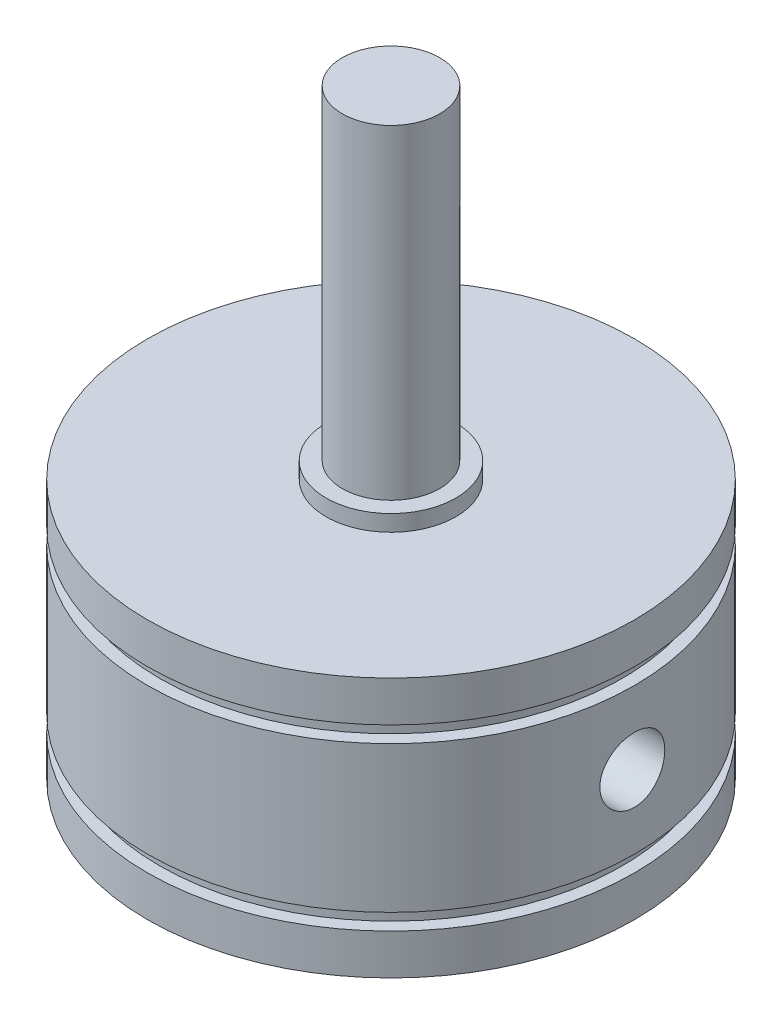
ISO-10303-21;
HEADER;
FILE_DESCRIPTION(('STEP AP214'),'2;1');
FILE_NAME('part.step','',(''),(''),'','','');
FILE_SCHEMA(('AUTOMOTIVE_DESIGN { 1 0 10303 214 1 1 1 1 }'));
ENDSEC;
DATA;
#1=APPLICATION_CONTEXT('core data for automotive mechanical design processes');
#2=APPLICATION_PROTOCOL_DEFINITION('international standard','automotive_design',2000,#1);
#3=PRODUCT_CONTEXT('',#1,'mechanical');
#4=PRODUCT('Part','Part','',(#3));
#5=PRODUCT_RELATED_PRODUCT_CATEGORY('part','',(#4));
#6=PRODUCT_DEFINITION_FORMATION('','',#4);
#7=PRODUCT_DEFINITION_CONTEXT('part definition',#1,'design');
#8=PRODUCT_DEFINITION('design','',#6,#7);
#9=PRODUCT_DEFINITION_SHAPE('','',#8);
#10=(LENGTH_UNIT() NAMED_UNIT(*) SI_UNIT(.MILLI.,.METRE.));
#11=(NAMED_UNIT(*) PLANE_ANGLE_UNIT() SI_UNIT($,.RADIAN.));
#12=(NAMED_UNIT(*) SI_UNIT($,.STERADIAN.) SOLID_ANGLE_UNIT());
#13=UNCERTAINTY_MEASURE_WITH_UNIT(LENGTH_MEASURE(1.E-05),#10,'distance_accuracy_value','');
#14=(GEOMETRIC_REPRESENTATION_CONTEXT(3) GLOBAL_UNCERTAINTY_ASSIGNED_CONTEXT((#13)) GLOBAL_UNIT_ASSIGNED_CONTEXT((#10,
#11,#12)) REPRESENTATION_CONTEXT('',''));
#15=CARTESIAN_POINT('',(0.,0.,0.));
#16=DIRECTION('',(0.,0.,1.));
#17=DIRECTION('',(1.,0.,0.));
#18=AXIS2_PLACEMENT_3D('',#15,#16,#17);
#19=CARTESIAN_POINT('',(3.00000000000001,-12.,0.));
#20=DIRECTION('',(0.,-1.,0.));
#21=DIRECTION('',(0.,0.,-1.));
#22=AXIS2_PLACEMENT_3D('',#19,#20,#21);
#23=PLANE('',#22);
#24=CARTESIAN_POINT('',(0.,-12.,0.));
#25=DIRECTION('',(0.,-1.,0.));
#26=DIRECTION('',(0.,0.,-1.));
#27=AXIS2_PLACEMENT_3D('',#24,#25,#26);
#28=CIRCLE('',#27,3.00000000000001);
#29=CARTESIAN_POINT('',(0.,-12.,-3.00000000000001));
#30=VERTEX_POINT('',#29);
#31=EDGE_CURVE('E81',#30,#30,#28,.T.);
#32=ORIENTED_EDGE('',*,*,#31,.T.);
#33=EDGE_LOOP('',(#32));
#34=FACE_BOUND('',#33,.T.);
#35=ADVANCED_FACE('F33',(#34),#23,.T.);
#36=CARTESIAN_POINT('',(0.,29.,0.));
#37=DIRECTION('',(0.,1.,0.));
#38=DIRECTION('',(0.,0.,1.));
#39=AXIS2_PLACEMENT_3D('',#36,#37,#38);
#40=PLANE('',#39);
#41=CARTESIAN_POINT('',(0.,29.,0.));
#42=DIRECTION('',(0.,-1.,0.));
#43=DIRECTION('',(0.,0.,-1.));
#44=AXIS2_PLACEMENT_3D('',#41,#42,#43);
#45=CIRCLE('',#44,3.);
#46=CARTESIAN_POINT('',(0.,29.,-3.));
#47=VERTEX_POINT('',#46);
#48=EDGE_CURVE('E140',#47,#47,#45,.T.);
#49=ORIENTED_EDGE('',*,*,#48,.F.);
#50=EDGE_LOOP('',(#49));
#51=FACE_BOUND('',#50,.T.);
#52=ADVANCED_FACE('F240',(#51),#40,.T.);
#53=CARTESIAN_POINT('',(0.,0.,0.));
#54=DIRECTION('',(0.,-1.,0.));
#55=DIRECTION('',(0.,0.,-1.));
#56=AXIS2_PLACEMENT_3D('',#53,#54,#55);
#57=CYLINDRICAL_SURFACE('',#56,3.);
#58=ORIENTED_EDGE('',*,*,#48,.T.);
#59=EDGE_LOOP('',(#58));
#60=FACE_BOUND('',#59,.T.);
#61=CARTESIAN_POINT('',(0.,9.,0.));
#62=DIRECTION('',(0.,-1.,0.));
#63=DIRECTION('',(0.,0.,-1.));
#64=AXIS2_PLACEMENT_3D('',#61,#62,#63);
#65=CIRCLE('',#64,3.);
#66=CARTESIAN_POINT('',(0.,9.,-3.));
#67=VERTEX_POINT('',#66);
#68=EDGE_CURVE('E137',#67,#67,#65,.T.);
#69=ORIENTED_EDGE('',*,*,#68,.F.);
#70=EDGE_LOOP('',(#69));
#71=FACE_BOUND('',#70,.T.);
#72=ADVANCED_FACE('F244',(#60,#71),#57,.T.);
#73=CARTESIAN_POINT('',(3.,9.,0.));
#74=DIRECTION('',(0.,1.,0.));
#75=DIRECTION('',(0.,0.,1.));
#76=AXIS2_PLACEMENT_3D('',#73,#74,#75);
#77=PLANE('',#76);
#78=ORIENTED_EDGE('',*,*,#68,.T.);
#79=EDGE_LOOP('',(#78));
#80=FACE_BOUND('',#79,.T.);
#81=CARTESIAN_POINT('',(0.,9.,0.));
#82=DIRECTION('',(0.,-1.,0.));
#83=DIRECTION('',(0.,0.,-1.));
#84=AXIS2_PLACEMENT_3D('',#81,#82,#83);
#85=CIRCLE('',#84,4.);
#86=CARTESIAN_POINT('',(0.,9.,-4.));
#87=VERTEX_POINT('',#86);
#88=EDGE_CURVE('E134',#87,#87,#85,.T.);
#89=ORIENTED_EDGE('',*,*,#88,.F.);
#90=EDGE_LOOP('',(#89));
#91=FACE_BOUND('',#90,.T.);
#92=ADVANCED_FACE('F249',(#80,#91),#77,.T.);
#93=CARTESIAN_POINT('',(0.,0.,0.));
#94=DIRECTION('',(0.,-1.,0.));
#95=DIRECTION('',(0.,0.,-1.));
#96=AXIS2_PLACEMENT_3D('',#93,#94,#95);
#97=CYLINDRICAL_SURFACE('',#96,4.);
#98=ORIENTED_EDGE('',*,*,#88,.T.);
#99=EDGE_LOOP('',(#98));
#100=FACE_BOUND('',#99,.T.);
#101=CARTESIAN_POINT('',(0.,8.,0.));
#102=DIRECTION('',(0.,-1.,0.));
#103=DIRECTION('',(0.,0.,-1.));
#104=AXIS2_PLACEMENT_3D('',#101,#102,#103);
#105=CIRCLE('',#104,4.);
#106=CARTESIAN_POINT('',(0.,8.,-4.));
#107=VERTEX_POINT('',#106);
#108=EDGE_CURVE('E131',#107,#107,#105,.T.);
#109=ORIENTED_EDGE('',*,*,#108,.F.);
#110=EDGE_LOOP('',(#109));
#111=FACE_BOUND('',#110,.T.);
#112=ADVANCED_FACE('F256',(#100,#111),#97,.T.);
#113=CARTESIAN_POINT('',(4.,8.,0.));
#114=DIRECTION('',(0.,1.,0.));
#115=DIRECTION('',(0.,0.,1.));
#116=AXIS2_PLACEMENT_3D('',#113,#114,#115);
#117=PLANE('',#116);
#118=ORIENTED_EDGE('',*,*,#108,.T.);
#119=EDGE_LOOP('',(#118));
#120=FACE_BOUND('',#119,.T.);
#121=CARTESIAN_POINT('',(0.,8.,0.));
#122=DIRECTION('',(0.,-1.,0.));
#123=DIRECTION('',(0.,0.,-1.));
#124=AXIS2_PLACEMENT_3D('',#121,#122,#123);
#125=CIRCLE('',#124,15.);
#126=CARTESIAN_POINT('',(0.,8.,-15.));
#127=VERTEX_POINT('',#126);
#128=EDGE_CURVE('E128',#127,#127,#125,.T.);
#129=ORIENTED_EDGE('',*,*,#128,.F.);
#130=EDGE_LOOP('',(#129));
#131=FACE_BOUND('',#130,.T.);
#132=ADVANCED_FACE('F260',(#120,#131),#117,.T.);
#133=CARTESIAN_POINT('',(0.,0.,0.));
#134=DIRECTION('',(0.,-1.,0.));
#135=DIRECTION('',(0.,0.,-1.));
#136=AXIS2_PLACEMENT_3D('',#133,#134,#135);
#137=CYLINDRICAL_SURFACE('',#136,15.);
#138=ORIENTED_EDGE('',*,*,#128,.T.);
#139=EDGE_LOOP('',(#138));
#140=FACE_BOUND('',#139,.T.);
#141=CARTESIAN_POINT('',(0.,5.5,0.));
#142=DIRECTION('',(0.,-1.,0.));
#143=DIRECTION('',(0.,0.,-1.));
#144=AXIS2_PLACEMENT_3D('',#141,#142,#143);
#145=CIRCLE('',#144,15.);
#146=CARTESIAN_POINT('',(0.,5.5,-15.));
#147=VERTEX_POINT('',#146);
#148=EDGE_CURVE('E125',#147,#147,#145,.T.);
#149=ORIENTED_EDGE('',*,*,#148,.F.);
#150=EDGE_LOOP('',(#149));
#151=FACE_BOUND('',#150,.T.);
#152=ADVANCED_FACE('F264',(#140,#151),#137,.T.);
#153=CARTESIAN_POINT('',(15.,5.5,0.));
#154=DIRECTION('',(0.,-1.,0.));
#155=DIRECTION('',(0.,0.,-1.));
#156=AXIS2_PLACEMENT_3D('',#153,#154,#155);
#157=PLANE('',#156);
#158=ORIENTED_EDGE('',*,*,#148,.T.);
#159=EDGE_LOOP('',(#158));
#160=FACE_BOUND('',#159,.T.);
#161=CARTESIAN_POINT('',(0.,5.5,0.));
#162=DIRECTION('',(0.,-1.,0.));
#163=DIRECTION('',(0.,0.,-1.));
#164=AXIS2_PLACEMENT_3D('',#161,#162,#163);
#165=CIRCLE('',#164,14.25);
#166=CARTESIAN_POINT('',(0.,5.5,-14.25));
#167=VERTEX_POINT('',#166);
#168=EDGE_CURVE('E122',#167,#167,#165,.T.);
#169=ORIENTED_EDGE('',*,*,#168,.F.);
#170=EDGE_LOOP('',(#169));
#171=FACE_BOUND('',#170,.T.);
#172=ADVANCED_FACE('F268',(#160,#171),#157,.T.);
#173=CARTESIAN_POINT('',(0.,0.,0.));
#174=DIRECTION('',(0.,-1.,0.));
#175=DIRECTION('',(0.,0.,-1.));
#176=AXIS2_PLACEMENT_3D('',#173,#174,#175);
#177=CYLINDRICAL_SURFACE('',#176,14.25);
#178=ORIENTED_EDGE('',*,*,#168,.T.);
#179=EDGE_LOOP('',(#178));
#180=FACE_BOUND('',#179,.T.);
#181=CARTESIAN_POINT('',(0.,4.5,0.));
#182=DIRECTION('',(0.,-1.,0.));
#183=DIRECTION('',(0.,0.,-1.));
#184=AXIS2_PLACEMENT_3D('',#181,#182,#183);
#185=CIRCLE('',#184,14.25);
#186=CARTESIAN_POINT('',(0.,4.5,-14.25));
#187=VERTEX_POINT('',#186);
#188=EDGE_CURVE('E119',#187,#187,#185,.T.);
#189=ORIENTED_EDGE('',*,*,#188,.F.);
#190=EDGE_LOOP('',(#189));
#191=FACE_BOUND('',#190,.T.);
#192=ADVANCED_FACE('F272',(#180,#191),#177,.T.);
#193=CARTESIAN_POINT('',(14.25,4.5,0.));
#194=DIRECTION('',(0.,1.,0.));
#195=DIRECTION('',(0.,0.,1.));
#196=AXIS2_PLACEMENT_3D('',#193,#194,#195);
#197=PLANE('',#196);
#198=ORIENTED_EDGE('',*,*,#188,.T.);
#199=EDGE_LOOP('',(#198));
#200=FACE_BOUND('',#199,.T.);
#201=CARTESIAN_POINT('',(0.,4.5,0.));
#202=DIRECTION('',(0.,-1.,0.));
#203=DIRECTION('',(0.,0.,-1.));
#204=AXIS2_PLACEMENT_3D('',#201,#202,#203);
#205=CIRCLE('',#204,15.);
#206=CARTESIAN_POINT('',(0.,4.5,-15.));
#207=VERTEX_POINT('',#206);
#208=EDGE_CURVE('E116',#207,#207,#205,.T.);
#209=ORIENTED_EDGE('',*,*,#208,.F.);
#210=EDGE_LOOP('',(#209));
#211=FACE_BOUND('',#210,.T.);
#212=ADVANCED_FACE('F188',(#200,#211),#197,.T.);
#213=CARTESIAN_POINT('',(0.,0.,0.));
#214=DIRECTION('',(0.,-1.,0.));
#215=DIRECTION('',(0.,0.,-1.));
#216=AXIS2_PLACEMENT_3D('',#213,#214,#215);
#217=CYLINDRICAL_SURFACE('',#216,15.);
#218=CARTESIAN_POINT('',(-13.4196952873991,0.,6.70162505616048));
#219=CARTESIAN_POINT('',(-13.419700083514,0.166693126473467,6.70161996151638));
#220=CARTESIAN_POINT('',(-13.4260724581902,0.333463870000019,6.68890156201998));
#221=CARTESIAN_POINT('',(-13.4511395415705,0.662287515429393,6.63834403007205));
#222=CARTESIAN_POINT('',(-13.469844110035,0.824336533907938,6.60048479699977));
#223=CARTESIAN_POINT('',(-13.5182900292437,1.13891191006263,6.50068368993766));
#224=CARTESIAN_POINT('',(-13.548020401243,1.29144756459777,6.43876576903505));
#225=CARTESIAN_POINT('',(-13.6166172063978,1.58302453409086,6.29239535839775));
#226=CARTESIAN_POINT('',(-13.6554831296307,1.7220666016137,6.2079441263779));
#227=CARTESIAN_POINT('',(-13.7405676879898,1.98468301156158,6.01729209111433));
#228=CARTESIAN_POINT('',(-13.7868733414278,2.10803876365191,5.91082897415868));
#229=CARTESIAN_POINT('',(-13.883833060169,2.33387260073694,5.6793395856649));
#230=CARTESIAN_POINT('',(-13.9344874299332,2.43634922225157,5.55431201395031));
#231=CARTESIAN_POINT('',(-14.0379007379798,2.61836405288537,5.28752828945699));
#232=CARTESIAN_POINT('',(-14.0906741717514,2.69769454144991,5.14563582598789));
#233=CARTESIAN_POINT('',(-14.1952584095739,2.8298248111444,4.84966397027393));
#234=CARTESIAN_POINT('',(-14.2470693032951,2.88262707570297,4.69558572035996));
#235=CARTESIAN_POINT('',(-14.3467325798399,2.95952158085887,4.38155584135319));
#236=CARTESIAN_POINT('',(-14.394628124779,2.98398293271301,4.22170834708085));
#237=CARTESIAN_POINT('',(-14.4854208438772,3.00465285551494,3.8988071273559));
#238=CARTESIAN_POINT('',(-14.5283184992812,3.00086414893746,3.73575371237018));
#239=CARTESIAN_POINT('',(-14.6073549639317,2.96542145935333,3.41354954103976));
#240=CARTESIAN_POINT('',(-14.6435813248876,2.93416506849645,3.25437627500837));
#241=CARTESIAN_POINT('',(-14.7094937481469,2.84530490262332,2.94215370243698));
#242=CARTESIAN_POINT('',(-14.7391795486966,2.78770007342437,2.78910464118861));
#243=CARTESIAN_POINT('',(-14.7922235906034,2.64740987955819,2.49258351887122));
#244=CARTESIAN_POINT('',(-14.8155407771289,2.56456874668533,2.34917788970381));
#245=CARTESIAN_POINT('',(-14.856128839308,2.37627276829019,2.07710974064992));
#246=CARTESIAN_POINT('',(-14.8733990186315,2.27081532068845,1.9484489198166));
#247=CARTESIAN_POINT('',(-14.9030007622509,2.03809913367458,1.70750805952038));
#248=CARTESIAN_POINT('',(-14.9152410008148,1.91049243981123,1.59555262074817));
#249=CARTESIAN_POINT('',(-14.9354082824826,1.63825067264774,1.39421950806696));
#250=CARTESIAN_POINT('',(-14.9433352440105,1.49361527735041,1.30484226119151));
#251=CARTESIAN_POINT('',(-14.9559412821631,1.19093750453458,1.15142795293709));
#252=CARTESIAN_POINT('',(-14.9606133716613,1.03286709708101,1.08744553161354));
#253=CARTESIAN_POINT('',(-14.9675536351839,0.708086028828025,0.987360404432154));
#254=CARTESIAN_POINT('',(-14.9698221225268,0.541376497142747,0.951254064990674));
#255=CARTESIAN_POINT('',(-14.9724699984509,0.207105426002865,0.908622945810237));
#256=CARTESIAN_POINT('',(-14.972881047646,0.0396072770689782,0.901602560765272));
#257=CARTESIAN_POINT('',(-14.9720045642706,-0.29414466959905,0.916040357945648));
#258=CARTESIAN_POINT('',(-14.9707171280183,-0.460398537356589,0.937496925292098));
#259=CARTESIAN_POINT('',(-14.9661496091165,-0.785305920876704,1.00775639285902));
#260=CARTESIAN_POINT('',(-14.9628887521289,-0.944017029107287,1.05629509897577));
#261=CARTESIAN_POINT('',(-14.9537303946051,-1.25118983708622,1.17885564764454));
#262=CARTESIAN_POINT('',(-14.9478326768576,-1.39965069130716,1.2528795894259));
#263=CARTESIAN_POINT('',(-14.9323986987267,-1.68423932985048,1.42513711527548));
#264=CARTESIAN_POINT('',(-14.9228160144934,-1.82018113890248,1.52367367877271));
#265=CARTESIAN_POINT('',(-14.8989774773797,-2.07392493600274,1.74138879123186));
#266=CARTESIAN_POINT('',(-14.8847211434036,-2.19172505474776,1.86056946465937));
#267=CARTESIAN_POINT('',(-14.8502902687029,-2.40768767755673,2.11801058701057));
#268=CARTESIAN_POINT('',(-14.8300282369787,-2.50552096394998,2.25653584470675));
#269=CARTESIAN_POINT('',(-14.7828957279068,-2.67643764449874,2.54708094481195));
#270=CARTESIAN_POINT('',(-14.7560255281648,-2.74952207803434,2.69910022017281));
#271=CARTESIAN_POINT('',(-14.695507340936,-2.8683866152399,3.01117234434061));
#272=CARTESIAN_POINT('',(-14.6618992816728,-2.91432155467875,3.17117388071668));
#273=CARTESIAN_POINT('',(-14.5880504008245,-2.97807374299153,3.49519271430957));
#274=CARTESIAN_POINT('',(-14.5478103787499,-2.99589437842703,3.65920952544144));
#275=CARTESIAN_POINT('',(-14.4623473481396,-3.00278094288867,3.98348352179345));
#276=CARTESIAN_POINT('',(-14.4172232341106,-2.99234184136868,4.14375646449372));
#277=CARTESIAN_POINT('',(-14.3228979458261,-2.94409814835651,4.45888467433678));
#278=CARTESIAN_POINT('',(-14.2736968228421,-2.9062939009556,4.61374000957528));
#279=CARTESIAN_POINT('',(-14.1733005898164,-2.80461302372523,4.91350189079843));
#280=CARTESIAN_POINT('',(-14.1221102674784,-2.74079586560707,5.05843025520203));
#281=CARTESIAN_POINT('',(-14.0199393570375,-2.58896327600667,5.33507939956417));
#282=CARTESIAN_POINT('',(-13.9689587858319,-2.50094593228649,5.46679913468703));
#283=CARTESIAN_POINT('',(-13.8689171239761,-2.30154183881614,5.71589598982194));
#284=CARTESIAN_POINT('',(-13.8199002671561,-2.18980099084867,5.83300744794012));
#285=CARTESIAN_POINT('',(-13.7273469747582,-1.94684927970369,6.04761414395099));
#286=CARTESIAN_POINT('',(-13.6838118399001,-1.81563381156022,6.14510472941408));
#287=CARTESIAN_POINT('',(-13.6043641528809,-1.53576204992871,6.31906201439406));
#288=CARTESIAN_POINT('',(-13.568538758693,-1.38693311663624,6.39529094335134));
#289=CARTESIAN_POINT('',(-13.5074490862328,-1.07720168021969,6.5233344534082));
#290=CARTESIAN_POINT('',(-13.4821752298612,-0.916310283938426,6.57517118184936));
#291=CARTESIAN_POINT('',(-13.4487684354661,-0.629212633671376,6.64316518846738));
#292=CARTESIAN_POINT('',(-13.4379061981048,-0.504643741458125,6.66505395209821));
#293=CARTESIAN_POINT('',(-13.4233679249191,-0.253398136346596,6.69428557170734));
#294=CARTESIAN_POINT('',(-13.4196916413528,-0.126721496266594,6.70162892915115));
#295=CARTESIAN_POINT('',(-13.4196952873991,0.,6.70162505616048));
#296=B_SPLINE_CURVE_WITH_KNOTS('',3,(#218,#219,#220,#221,#222,#223,#224,#225,#226,#227,#228,
#229,#230,#231,#232,#233,#234,#235,#236,#237,#238,#239,#240,#241,#242,#243,#244,#245,#246,#247,
#248,#249,#250,#251,#252,#253,#254,#255,#256,#257,#258,#259,#260,#261,#262,#263,#264,#265,#266,
#267,#268,#269,#270,#271,#272,#273,#274,#275,#276,#277,#278,#279,#280,#281,#282,#283,#284,#285,
#286,#287,#288,#289,#290,#291,#292,#293,#294,#295),.UNSPECIFIED.,.T.,.F.,(4,2,2,2,2,2,2,2,2,2,2,
2,2,2,2,2,2,2,2,2,2,2,2,2,2,2,2,2,2,2,2,2,2,2,2,2,2,2,4),(0.,0.499615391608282,
0.999630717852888,1.49914949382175,1.99864039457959,2.5044675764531,3.01033020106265,
3.5206020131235,4.03082604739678,4.5343274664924,5.03778036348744,5.53406368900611,
6.0303668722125,6.52979772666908,7.02928607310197,7.53748040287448,8.04568434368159,
8.55497589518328,9.06420105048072,9.56471273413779,10.0651960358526,10.5608802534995,
11.0566053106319,11.5587917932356,12.0610299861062,12.5709780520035,13.0809046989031,
13.5878944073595,14.0948230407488,14.5929305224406,15.0910317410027,15.5880005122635,
16.0850085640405,16.5900345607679,17.0951801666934,17.6057669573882,18.1158892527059,
18.4957141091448,18.8755258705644),.UNSPECIFIED.);
#297=CARTESIAN_POINT('',(-13.4196952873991,0.,6.70162505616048));
#298=VERTEX_POINT('',#297);
#299=EDGE_CURVE('E76',#298,#298,#296,.T.);
#300=ORIENTED_EDGE('',*,*,#299,.F.);
#301=EDGE_LOOP('',(#300));
#302=FACE_BOUND('',#301,.T.);
#303=CARTESIAN_POINT('',(-14.9726095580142,0.,-0.906070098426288));
#304=CARTESIAN_POINT('',(-14.9726111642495,0.166693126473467,-0.906076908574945));
#305=CARTESIAN_POINT('',(-14.9717706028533,0.333463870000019,-0.920277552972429));
#306=CARTESIAN_POINT('',(-14.9682005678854,0.662287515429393,-0.976595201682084));
#307=CARTESIAN_POINT('',(-14.9654695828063,0.824336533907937,-1.01873454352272));
#308=CARTESIAN_POINT('',(-14.9575244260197,1.13891191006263,-1.12938779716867));
#309=CARTESIAN_POINT('',(-14.9523127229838,1.29144756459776,-1.19787547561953));
#310=CARTESIAN_POINT('',(-14.9385340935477,1.58302453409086,-1.35893437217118));
#311=CARTESIAN_POINT('',(-14.9299673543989,1.7220666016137,-1.45150424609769));
#312=CARTESIAN_POINT('',(-14.908326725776,1.98468301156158,-1.65915603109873));
#313=CARTESIAN_POINT('',(-14.8951970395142,2.10803876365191,-1.77450862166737));
#314=CARTESIAN_POINT('',(-14.863421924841,2.33387260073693,-2.02346417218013));
#315=CARTESIAN_POINT('',(-14.8447761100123,2.43634922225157,-2.15706841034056));
#316=CARTESIAN_POINT('',(-14.8009427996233,2.61836405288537,-2.43981654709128));
#317=CARTESIAN_POINT('',(-14.7756997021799,2.69769454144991,-2.58908574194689));
#318=CARTESIAN_POINT('',(-14.7182863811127,2.8298248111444,-2.89769700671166));
#319=CARTESIAN_POINT('',(-14.686116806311,2.88262707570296,-3.05703813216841));
#320=CARTESIAN_POINT('',(-14.6154127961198,2.95952158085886,-3.37882762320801));
#321=CARTESIAN_POINT('',(-14.576967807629,2.98398293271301,-3.54120738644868));
#322=CARTESIAN_POINT('',(-14.4941459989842,3.00465285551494,-3.86624440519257));
#323=CARTESIAN_POINT('',(-14.449769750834,3.00086414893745,-4.02890163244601));
#324=CARTESIAN_POINT('',(-14.3571152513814,2.96542145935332,-4.3474568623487));
#325=CARTESIAN_POINT('',(-14.3089015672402,2.93416506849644,-4.50341813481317));
#326=CARTESIAN_POINT('',(-14.2098721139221,2.84530490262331,-4.80676702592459));
#327=CARTESIAN_POINT('',(-14.1590562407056,2.78770007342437,-4.95415430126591));
#328=CARTESIAN_POINT('',(-14.0567331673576,2.64740987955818,-5.23747114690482));
#329=CARTESIAN_POINT('',(-14.0052236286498,2.56456874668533,-5.37332265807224));
#330=CARTESIAN_POINT('',(-13.9043398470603,2.37627276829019,-5.62923461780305));
#331=CARTESIAN_POINT('',(-13.8549658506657,2.27081532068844,-5.74929324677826));
#332=CARTESIAN_POINT('',(-13.7601312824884,2.03809913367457,-5.97275502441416));
#333=CARTESIAN_POINT('',(-13.7147539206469,1.91049243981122,-6.07583139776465));
#334=CARTESIAN_POINT('',(-13.6315527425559,1.63825067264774,-6.26027462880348));
#335=CARTESIAN_POINT('',(-13.5937290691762,1.49361527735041,-6.3416410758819));
#336=CARTESIAN_POINT('',(-13.5279390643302,1.19093750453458,-6.48080478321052));
#337=CARTESIAN_POINT('',(-13.4999940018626,1.03286709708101,-6.53855123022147));
#338=CARTESIAN_POINT('',(-13.4559618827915,0.708086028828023,-6.62869762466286));
#339=CARTESIAN_POINT('',(-13.4398732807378,0.541376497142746,-6.66110087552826));
#340=CARTESIAN_POINT('',(-13.4208508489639,0.207105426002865,-6.69934444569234));
#341=CARTESIAN_POINT('',(-13.4176966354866,0.0396072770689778,-6.70562980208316));
#342=CARTESIAN_POINT('',(-13.4241564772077,-0.29414466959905,-6.69268806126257));
#343=CARTESIAN_POINT('',(-13.4337698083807,-0.460398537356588,-6.6734624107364));
#344=CARTESIAN_POINT('',(-13.464943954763,-0.785305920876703,-6.61033216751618));
#345=CARTESIAN_POINT('',(-13.4863893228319,-0.944017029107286,-6.56666598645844));
#346=CARTESIAN_POINT('',(-13.5397382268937,-1.25118983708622,-6.45594625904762));
#347=CARTESIAN_POINT('',(-13.5716426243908,-1.39965069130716,-6.38889078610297));
#348=CARTESIAN_POINT('',(-13.6444051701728,-1.68423932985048,-6.23199440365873));
#349=CARTESIAN_POINT('',(-13.6853746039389,-1.82018113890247,-6.14186789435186));
#350=CARTESIAN_POINT('',(-13.7735873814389,-2.07392493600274,-5.94140180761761));
#351=CARTESIAN_POINT('',(-13.8208313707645,-2.19172505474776,-5.83106014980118));
#352=CARTESIAN_POINT('',(-13.9197339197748,-2.40768767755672,-5.59089416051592));
#353=CARTESIAN_POINT('',(-13.9714491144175,-2.50552096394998,-5.46079675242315));
#354=CARTESIAN_POINT('',(-14.0759037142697,-2.67643764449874,-5.18561106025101));
#355=CARTESIAN_POINT('',(-14.1286430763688,-2.74952207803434,-5.0405234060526));
#356=CARTESIAN_POINT('',(-14.2322688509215,-2.86838661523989,-4.74000192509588));
#357=CARTESIAN_POINT('',(-14.2831641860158,-2.91432155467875,-4.58463250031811));
#358=CARTESIAN_POINT('',(-14.3812185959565,-2.97807374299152,-4.26709951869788));
#359=CARTESIAN_POINT('',(-14.428378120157,-2.99589437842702,-4.10493678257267));
#360=CARTESIAN_POINT('',(-14.5165019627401,-3.00278094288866,-3.78137574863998));
#361=CARTESIAN_POINT('',(-14.5575598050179,-2.99234184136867,-3.62001325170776));
#362=CARTESIAN_POINT('',(-14.6334358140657,-2.94409814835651,-3.29994157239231));
#363=CARTESIAN_POINT('',(-14.6682540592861,-2.9062939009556,-3.1412323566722));
#364=CARTESIAN_POINT('',(-14.7311893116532,-2.80461302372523,-2.83143283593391));
#365=CARTESIAN_POINT('',(-14.7593213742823,-2.74079586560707,-2.68032602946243));
#366=CARTESIAN_POINT('',(-14.8091633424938,-2.58896327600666,-2.38965538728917));
#367=CARTESIAN_POINT('',(-14.8308727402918,-2.50094593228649,-2.25009246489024));
#368=CARTESIAN_POINT('',(-14.8687825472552,-2.30154183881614,-1.98434742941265));
#369=CARTESIAN_POINT('',(-14.8848884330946,-2.18980099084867,-1.8584175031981));
#370=CARTESIAN_POINT('',(-14.9120382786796,-1.94684927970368,-1.62628600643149));
#371=CARTESIAN_POINT('',(-14.9230810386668,-1.81563381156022,-1.52008911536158));
#372=CARTESIAN_POINT('',(-14.9412559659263,-1.5357620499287,-1.32971384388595));
#373=CARTESIAN_POINT('',(-14.9483447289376,-1.38693311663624,-1.24578495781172));
#374=CARTESIAN_POINT('',(-14.9594612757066,-1.07720168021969,-1.10435118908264));
#375=CARTESIAN_POINT('',(-14.9634918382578,-0.916310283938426,-1.04682233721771));
#376=CARTESIAN_POINT('',(-14.9685577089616,-0.629212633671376,-0.971234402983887));
#377=CARTESIAN_POINT('',(-14.9700951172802,-0.504643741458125,-0.9468470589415));
#378=CARTESIAN_POINT('',(-14.9721204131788,-0.253398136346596,-0.914262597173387));
#379=CARTESIAN_POINT('',(-14.9726083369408,-0.126721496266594,-0.906064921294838));
#380=CARTESIAN_POINT('',(-14.9726095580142,0.,-0.906070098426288));
#381=B_SPLINE_CURVE_WITH_KNOTS('',3,(#303,#304,#305,#306,#307,#308,#309,#310,#311,#312,#313,
#314,#315,#316,#317,#318,#319,#320,#321,#322,#323,#324,#325,#326,#327,#328,#329,#330,#331,#332,
#333,#334,#335,#336,#337,#338,#339,#340,#341,#342,#343,#344,#345,#346,#347,#348,#349,#350,#351,
#352,#353,#354,#355,#356,#357,#358,#359,#360,#361,#362,#363,#364,#365,#366,#367,#368,#369,#370,
#371,#372,#373,#374,#375,#376,#377,#378,#379,#380),.UNSPECIFIED.,.T.,.F.,(4,2,2,2,2,2,2,2,2,2,2,
2,2,2,2,2,2,2,2,2,2,2,2,2,2,2,2,2,2,2,2,2,2,2,2,2,2,2,4),(0.,0.499615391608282,
0.999630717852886,1.49914949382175,1.99864039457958,2.50446757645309,3.01033020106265,
3.52060201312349,4.03082604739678,4.5343274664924,5.03778036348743,5.5340636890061,
6.03036687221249,6.52979772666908,7.02928607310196,7.53748040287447,8.04568434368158,
8.55497589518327,9.06420105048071,9.56471273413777,10.0651960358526,10.5608802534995,
11.0566053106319,11.5587917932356,12.0610299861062,12.5709780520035,13.0809046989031,
13.5878944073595,14.0948230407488,14.5929305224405,15.0910317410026,15.5880005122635,
16.0850085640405,16.5900345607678,17.0951801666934,17.6057669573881,18.1158892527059,
18.4957141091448,18.8755258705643),.UNSPECIFIED.);
#382=CARTESIAN_POINT('',(-14.9726095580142,0.,-0.906070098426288));
#383=VERTEX_POINT('',#382);
#384=EDGE_CURVE('E148',#383,#383,#381,.T.);
#385=ORIENTED_EDGE('',*,*,#384,.F.);
#386=EDGE_LOOP('',(#385));
#387=FACE_BOUND('',#386,.T.);
#388=CARTESIAN_POINT('',(14.8660687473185,0.,-1.99999999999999));
#389=CARTESIAN_POINT('',(14.8660704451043,0.111803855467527,-1.99999528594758));
#390=CARTESIAN_POINT('',(14.8673436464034,0.223676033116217,-1.99059326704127));
#391=CARTESIAN_POINT('',(14.8722964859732,0.444302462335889,-1.95323796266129));
#392=CARTESIAN_POINT('',(14.8759785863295,0.553053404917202,-1.92526569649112));
#393=CARTESIAN_POINT('',(14.8853249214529,0.764211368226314,-1.85161311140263));
#394=CARTESIAN_POINT('',(14.8909877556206,0.866622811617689,-1.80594530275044));
#395=CARTESIAN_POINT('',(14.9036558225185,1.06231107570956,-1.69822564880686));
#396=CARTESIAN_POINT('',(14.9106608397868,1.15558935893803,-1.63617643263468));
#397=CARTESIAN_POINT('',(14.9252737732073,1.33097345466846,-1.49703370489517));
#398=CARTESIAN_POINT('',(14.9328848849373,1.41301286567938,-1.41985682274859));
#399=CARTESIAN_POINT('',(14.9478237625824,1.56301624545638,-1.2528292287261));
#400=CARTESIAN_POINT('',(14.9551515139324,1.63097949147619,-1.16297786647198));
#401=CARTESIAN_POINT('',(14.9687309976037,1.7511418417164,-0.972731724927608));
#402=CARTESIAN_POINT('',(14.9749785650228,1.80328048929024,-0.872298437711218));
#403=CARTESIAN_POINT('',(14.9856585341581,1.88992616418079,-0.664003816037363));
#404=CARTESIAN_POINT('',(14.990091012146,1.92443393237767,-0.556142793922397));
#405=CARTESIAN_POINT('',(14.9966188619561,1.97463890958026,-0.336735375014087));
#406=CARTESIAN_POINT('',(14.9987279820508,1.99044681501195,-0.225214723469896));
#407=CARTESIAN_POINT('',(15.0004184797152,2.00314660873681,-0.00108500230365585));
#408=CARTESIAN_POINT('',(14.9999999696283,2.00003933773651,0.111524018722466));
#409=CARTESIAN_POINT('',(14.9966934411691,1.97508526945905,0.333880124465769));
#410=CARTESIAN_POINT('',(14.9938211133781,1.95335753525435,0.443640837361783));
#411=CARTESIAN_POINT('',(14.9859472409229,1.89196567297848,0.657944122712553));
#412=CARTESIAN_POINT('',(14.9809456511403,1.85230116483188,0.762486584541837));
#413=CARTESIAN_POINT('',(14.9693481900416,1.75603655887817,0.963751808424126));
#414=CARTESIAN_POINT('',(14.9627475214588,1.69938537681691,1.06044984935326));
#415=CARTESIAN_POINT('',(14.9486895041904,1.57079274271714,1.24301169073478));
#416=CARTESIAN_POINT('',(14.9412321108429,1.49885049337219,1.32887492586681));
#417=CARTESIAN_POINT('',(14.9262258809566,1.34105215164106,1.48803006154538));
#418=CARTESIAN_POINT('',(14.918676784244,1.25509223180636,1.56121903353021));
#419=CARTESIAN_POINT('',(14.9043949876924,1.07205406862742,1.6921469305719));
#420=CARTESIAN_POINT('',(14.8976622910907,0.974975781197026,1.74988579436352));
#421=CARTESIAN_POINT('',(14.8857757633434,0.772359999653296,1.84828286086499));
#422=CARTESIAN_POINT('',(14.8806227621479,0.66681809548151,1.88893208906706));
#423=CARTESIAN_POINT('',(14.8724947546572,0.450321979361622,1.95190090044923));
#424=CARTESIAN_POINT('',(14.8695196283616,0.339368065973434,1.97422149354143));
#425=CARTESIAN_POINT('',(14.8661064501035,0.116108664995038,1.99976160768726));
#426=CARTESIAN_POINT('',(14.8656491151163,0.00382006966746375,2.00312631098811));
#427=CARTESIAN_POINT('',(14.867272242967,-0.219719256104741,1.99104288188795));
#428=CARTESIAN_POINT('',(14.8693526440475,-0.330970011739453,1.97559520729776));
#429=CARTESIAN_POINT('',(14.8757992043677,-0.548835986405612,1.92644805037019));
#430=CARTESIAN_POINT('',(14.8801564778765,-0.655467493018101,1.89281950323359));
#431=CARTESIAN_POINT('',(14.8906585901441,-0.861578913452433,1.80833845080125));
#432=CARTESIAN_POINT('',(14.8968034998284,-0.961058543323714,1.75748526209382));
#433=CARTESIAN_POINT('',(14.9102344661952,-1.15069731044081,1.6396440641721));
#434=CARTESIAN_POINT('',(14.9175271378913,-1.24079704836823,1.572561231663));
#435=CARTESIAN_POINT('',(14.9324114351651,-1.40851093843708,1.42429832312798));
#436=CARTESIAN_POINT('',(14.9400030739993,-1.48612453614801,1.34311762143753));
#437=CARTESIAN_POINT('',(14.9546894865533,-1.62717655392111,1.16832754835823));
#438=CARTESIAN_POINT('',(14.9617807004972,-1.69051931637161,1.07464064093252));
#439=CARTESIAN_POINT('',(14.974613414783,-1.80056828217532,0.877872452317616));
#440=CARTESIAN_POINT('',(14.9803549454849,-1.8472748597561,0.774791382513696));
#441=CARTESIAN_POINT('',(14.9898256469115,-1.92256926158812,0.562472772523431));
#442=CARTESIAN_POINT('',(14.9935608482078,-1.95121142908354,0.45325478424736));
#443=CARTESIAN_POINT('',(14.9986231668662,-1.98974048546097,0.231506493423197));
#444=CARTESIAN_POINT('',(14.9999504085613,-1.99962834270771,0.118976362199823));
#445=CARTESIAN_POINT('',(15.0000464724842,-2.00034826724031,-0.105269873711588));
#446=CARTESIAN_POINT('',(14.9988350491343,-1.99132747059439,-0.21698552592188));
#447=CARTESIAN_POINT('',(14.9940293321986,-1.95479895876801,-0.437297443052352));
#448=CARTESIAN_POINT('',(14.9904350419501,-1.92729126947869,-0.545893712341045));
#449=CARTESIAN_POINT('',(14.9812655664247,-1.85461795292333,-0.756858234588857));
#450=CARTESIAN_POINT('',(14.9756912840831,-1.80946037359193,-0.859229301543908));
#451=CARTESIAN_POINT('',(14.9631774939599,-1.70278445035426,-1.05496407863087));
#452=CARTESIAN_POINT('',(14.95623796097,-1.64126580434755,-1.14832762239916));
#453=CARTESIAN_POINT('',(14.9417029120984,-1.50307331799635,-1.32414728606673));
#454=CARTESIAN_POINT('',(14.9341029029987,-1.4262902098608,-1.40651715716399));
#455=CARTESIAN_POINT('',(14.919138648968,-1.25997693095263,-1.55725895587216));
#456=CARTESIAN_POINT('',(14.9117744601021,-1.17044375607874,-1.62562757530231));
#457=CARTESIAN_POINT('',(14.8980810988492,-0.980716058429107,-1.74668790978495));
#458=CARTESIAN_POINT('',(14.8917566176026,-0.880476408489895,-1.79930940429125));
#459=CARTESIAN_POINT('',(14.8809136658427,-0.672551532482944,-1.8868951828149));
#460=CARTESIAN_POINT('',(14.8763932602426,-0.564874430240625,-1.92187839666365));
#461=CARTESIAN_POINT('',(14.8707513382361,-0.380551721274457,-1.96495480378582));
#462=CARTESIAN_POINT('',(14.8690042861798,-0.305061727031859,-1.97807748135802));
#463=CARTESIAN_POINT('',(14.866662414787,-0.153058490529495,-1.99560165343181));
#464=CARTESIAN_POINT('',(14.8660675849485,-0.0765452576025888,-2.00000322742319));
#465=CARTESIAN_POINT('',(14.8660687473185,0.,-1.99999999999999));
#466=B_SPLINE_CURVE_WITH_KNOTS('',3,(#388,#389,#390,#391,#392,#393,#394,#395,#396,#397,#398,
#399,#400,#401,#402,#403,#404,#405,#406,#407,#408,#409,#410,#411,#412,#413,#414,#415,#416,#417,
#418,#419,#420,#421,#422,#423,#424,#425,#426,#427,#428,#429,#430,#431,#432,#433,#434,#435,#436,
#437,#438,#439,#440,#441,#442,#443,#444,#445,#446,#447,#448,#449,#450,#451,#452,#453,#454,#455,
#456,#457,#458,#459,#460,#461,#462,#463,#464,#465),.UNSPECIFIED.,.T.,.F.,(4,2,2,2,2,2,2,2,2,2,2,
2,2,2,2,2,2,2,2,2,2,2,2,2,2,2,2,2,2,2,2,2,2,2,2,2,2,2,4),(0.,0.335131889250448,0.67060684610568,
1.00584506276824,1.34102950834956,1.67811595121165,2.01521969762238,2.35359556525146,
2.69195721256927,3.02830569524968,3.36463922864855,3.69883808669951,4.03304402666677,
4.3682652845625,4.70350402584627,5.04134915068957,5.37919561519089,5.71721927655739,
6.05522431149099,6.39063702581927,6.72604157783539,7.06014684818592,7.39426537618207,
7.7303852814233,8.06652010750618,8.40484511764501,8.74316251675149,9.08045723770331,
9.41773454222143,9.75239709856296,10.0870591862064,10.4215688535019,10.7560846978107,
11.0930874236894,11.430169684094,11.768733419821,12.1069330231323,12.3363794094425,
12.56582370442),.UNSPECIFIED.);
#467=CARTESIAN_POINT('',(14.8660687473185,0.,-1.99999999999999));
#468=VERTEX_POINT('',#467);
#469=EDGE_CURVE('E143',#468,#468,#466,.T.);
#470=ORIENTED_EDGE('',*,*,#469,.F.);
#471=EDGE_LOOP('',(#470));
#472=FACE_BOUND('',#471,.T.);
#473=ORIENTED_EDGE('',*,*,#208,.T.);
#474=EDGE_LOOP('',(#473));
#475=FACE_BOUND('',#474,.T.);
#476=CARTESIAN_POINT('',(0.,-4.5,0.));
#477=DIRECTION('',(0.,-1.,0.));
#478=DIRECTION('',(0.,0.,-1.));
#479=AXIS2_PLACEMENT_3D('',#476,#477,#478);
#480=CIRCLE('',#479,15.);
#481=CARTESIAN_POINT('',(0.,-4.5,-15.));
#482=VERTEX_POINT('',#481);
#483=EDGE_CURVE('E113',#482,#482,#480,.T.);
#484=ORIENTED_EDGE('',*,*,#483,.F.);
#485=EDGE_LOOP('',(#484));
#486=FACE_BOUND('',#485,.T.);
#487=ADVANCED_FACE('F152',(#302,#387,#472,#475,#486),#217,.T.);
#488=CARTESIAN_POINT('',(14.25,-4.5,0.));
#489=DIRECTION('',(0.,-1.,0.));
#490=DIRECTION('',(0.,0.,-1.));
#491=AXIS2_PLACEMENT_3D('',#488,#489,#490);
#492=PLANE('',#491);
#493=ORIENTED_EDGE('',*,*,#483,.T.);
#494=EDGE_LOOP('',(#493));
#495=FACE_BOUND('',#494,.T.);
#496=CARTESIAN_POINT('',(0.,-4.5,0.));
#497=DIRECTION('',(0.,-1.,0.));
#498=DIRECTION('',(0.,0.,-1.));
#499=AXIS2_PLACEMENT_3D('',#496,#497,#498);
#500=CIRCLE('',#499,14.25);
#501=CARTESIAN_POINT('',(0.,-4.5,-14.25));
#502=VERTEX_POINT('',#501);
#503=EDGE_CURVE('E110',#502,#502,#500,.T.);
#504=ORIENTED_EDGE('',*,*,#503,.F.);
#505=EDGE_LOOP('',(#504));
#506=FACE_BOUND('',#505,.T.);
#507=ADVANCED_FACE('F187',(#495,#506),#492,.T.);
#508=CARTESIAN_POINT('',(0.,0.,0.));
#509=DIRECTION('',(0.,-1.,0.));
#510=DIRECTION('',(0.,0.,-1.));
#511=AXIS2_PLACEMENT_3D('',#508,#509,#510);
#512=CYLINDRICAL_SURFACE('',#511,14.25);
#513=ORIENTED_EDGE('',*,*,#503,.T.);
#514=EDGE_LOOP('',(#513));
#515=FACE_BOUND('',#514,.T.);
#516=CARTESIAN_POINT('',(0.,-5.5,0.));
#517=DIRECTION('',(0.,-1.,0.));
#518=DIRECTION('',(0.,0.,-1.));
#519=AXIS2_PLACEMENT_3D('',#516,#517,#518);
#520=CIRCLE('',#519,14.25);
#521=CARTESIAN_POINT('',(0.,-5.5,-14.25));
#522=VERTEX_POINT('',#521);
#523=EDGE_CURVE('E107',#522,#522,#520,.T.);
#524=ORIENTED_EDGE('',*,*,#523,.F.);
#525=EDGE_LOOP('',(#524));
#526=FACE_BOUND('',#525,.T.);
#527=ADVANCED_FACE('F198',(#515,#526),#512,.T.);
#528=CARTESIAN_POINT('',(15.,-5.5,0.));
#529=DIRECTION('',(0.,1.,0.));
#530=DIRECTION('',(0.,0.,1.));
#531=AXIS2_PLACEMENT_3D('',#528,#529,#530);
#532=PLANE('',#531);
#533=ORIENTED_EDGE('',*,*,#523,.T.);
#534=EDGE_LOOP('',(#533));
#535=FACE_BOUND('',#534,.T.);
#536=CARTESIAN_POINT('',(0.,-5.5,0.));
#537=DIRECTION('',(0.,-1.,0.));
#538=DIRECTION('',(0.,0.,-1.));
#539=AXIS2_PLACEMENT_3D('',#536,#537,#538);
#540=CIRCLE('',#539,15.);
#541=CARTESIAN_POINT('',(0.,-5.5,-15.));
#542=VERTEX_POINT('',#541);
#543=EDGE_CURVE('E104',#542,#542,#540,.T.);
#544=ORIENTED_EDGE('',*,*,#543,.F.);
#545=EDGE_LOOP('',(#544));
#546=FACE_BOUND('',#545,.T.);
#547=ADVANCED_FACE('F203',(#535,#546),#532,.T.);
#548=CARTESIAN_POINT('',(0.,0.,0.));
#549=DIRECTION('',(0.,-1.,0.));
#550=DIRECTION('',(0.,0.,-1.));
#551=AXIS2_PLACEMENT_3D('',#548,#549,#550);
#552=CYLINDRICAL_SURFACE('',#551,15.);
#553=ORIENTED_EDGE('',*,*,#543,.T.);
#554=EDGE_LOOP('',(#553));
#555=FACE_BOUND('',#554,.T.);
#556=CARTESIAN_POINT('',(0.,-8.,0.));
#557=DIRECTION('',(0.,-1.,0.));
#558=DIRECTION('',(0.,0.,-1.));
#559=AXIS2_PLACEMENT_3D('',#556,#557,#558);
#560=CIRCLE('',#559,15.);
#561=CARTESIAN_POINT('',(0.,-8.,-15.));
#562=VERTEX_POINT('',#561);
#563=EDGE_CURVE('E101',#562,#562,#560,.T.);
#564=ORIENTED_EDGE('',*,*,#563,.F.);
#565=EDGE_LOOP('',(#564));
#566=FACE_BOUND('',#565,.T.);
#567=ADVANCED_FACE('F209',(#555,#566),#552,.T.);
#568=CARTESIAN_POINT('',(4.,-8.,0.));
#569=DIRECTION('',(0.,-1.,0.));
#570=DIRECTION('',(0.,0.,-1.));
#571=AXIS2_PLACEMENT_3D('',#568,#569,#570);
#572=PLANE('',#571);
#573=ORIENTED_EDGE('',*,*,#563,.T.);
#574=EDGE_LOOP('',(#573));
#575=FACE_BOUND('',#574,.T.);
#576=CARTESIAN_POINT('',(0.,-8.,0.));
#577=DIRECTION('',(0.,-1.,0.));
#578=DIRECTION('',(0.,0.,-1.));
#579=AXIS2_PLACEMENT_3D('',#576,#577,#578);
#580=CIRCLE('',#579,4.);
#581=CARTESIAN_POINT('',(0.,-8.,-4.));
#582=VERTEX_POINT('',#581);
#583=EDGE_CURVE('E98',#582,#582,#580,.T.);
#584=ORIENTED_EDGE('',*,*,#583,.F.);
#585=EDGE_LOOP('',(#584));
#586=FACE_BOUND('',#585,.T.);
#587=ADVANCED_FACE('F215',(#575,#586),#572,.T.);
#588=CARTESIAN_POINT('',(0.,0.,0.));
#589=DIRECTION('',(0.,-1.,0.));
#590=DIRECTION('',(0.,0.,-1.));
#591=AXIS2_PLACEMENT_3D('',#588,#589,#590);
#592=CYLINDRICAL_SURFACE('',#591,4.);
#593=ORIENTED_EDGE('',*,*,#583,.T.);
#594=EDGE_LOOP('',(#593));
#595=FACE_BOUND('',#594,.T.);
#596=CARTESIAN_POINT('',(0.,-9.,0.));
#597=DIRECTION('',(0.,-1.,0.));
#598=DIRECTION('',(0.,0.,-1.));
#599=AXIS2_PLACEMENT_3D('',#596,#597,#598);
#600=CIRCLE('',#599,4.);
#601=CARTESIAN_POINT('',(0.,-9.,-4.));
#602=VERTEX_POINT('',#601);
#603=EDGE_CURVE('E95',#602,#602,#600,.T.);
#604=ORIENTED_EDGE('',*,*,#603,.F.);
#605=EDGE_LOOP('',(#604));
#606=FACE_BOUND('',#605,.T.);
#607=ADVANCED_FACE('F221',(#595,#606),#592,.T.);
#608=CARTESIAN_POINT('',(3.,-9.,0.));
#609=DIRECTION('',(0.,-1.,0.));
#610=DIRECTION('',(0.,0.,-1.));
#611=AXIS2_PLACEMENT_3D('',#608,#609,#610);
#612=PLANE('',#611);
#613=ORIENTED_EDGE('',*,*,#603,.T.);
#614=EDGE_LOOP('',(#613));
#615=FACE_BOUND('',#614,.T.);
#616=CARTESIAN_POINT('',(0.,-9.,0.));
#617=DIRECTION('',(0.,-1.,0.));
#618=DIRECTION('',(0.,0.,-1.));
#619=AXIS2_PLACEMENT_3D('',#616,#617,#618);
#620=CIRCLE('',#619,3.);
#621=CARTESIAN_POINT('',(0.,-9.,-3.));
#622=VERTEX_POINT('',#621);
#623=EDGE_CURVE('E92',#622,#622,#620,.T.);
#624=ORIENTED_EDGE('',*,*,#623,.F.);
#625=EDGE_LOOP('',(#624));
#626=FACE_BOUND('',#625,.T.);
#627=ADVANCED_FACE('F227',(#615,#626),#612,.T.);
#628=CARTESIAN_POINT('',(0.,0.,0.));
#629=DIRECTION('',(0.,-1.,0.));
#630=DIRECTION('',(0.,0.,-1.));
#631=AXIS2_PLACEMENT_3D('',#628,#629,#630);
#632=CYLINDRICAL_SURFACE('',#631,3.00000000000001);
#633=ORIENTED_EDGE('',*,*,#623,.T.);
#634=EDGE_LOOP('',(#633));
#635=FACE_BOUND('',#634,.T.);
#636=ORIENTED_EDGE('',*,*,#31,.F.);
#637=EDGE_LOOP('',(#636));
#638=FACE_BOUND('',#637,.T.);
#639=ADVANCED_FACE('F160',(#635,#638),#632,.T.);
#640=CARTESIAN_POINT('',(15.,0.,0.));
#641=DIRECTION('',(1.,0.,0.));
#642=DIRECTION('',(0.,0.,-1.));
#643=AXIS2_PLACEMENT_3D('',#640,#641,#642);
#644=CYLINDRICAL_SURFACE('',#643,1.99999999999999);
#645=CARTESIAN_POINT('',(0.879493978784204,-1.5699546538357,-1.23904898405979));
#646=CARTESIAN_POINT('',(0.864144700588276,-1.62888867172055,-1.16437414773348));
#647=CARTESIAN_POINT('',(0.847887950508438,-1.68240266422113,-1.08559202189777));
#648=CARTESIAN_POINT('',(0.813844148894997,-1.77762512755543,-0.921447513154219));
#649=CARTESIAN_POINT('',(0.796056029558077,-1.81932527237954,-0.836080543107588));
#650=CARTESIAN_POINT('',(0.755675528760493,-1.89704756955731,-0.643414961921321));
#651=CARTESIAN_POINT('',(0.732821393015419,-1.93039046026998,-0.535078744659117));
#652=CARTESIAN_POINT('',(0.685927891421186,-1.97833201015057,-0.314561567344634));
#653=CARTESIAN_POINT('',(0.661888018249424,-1.99292257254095,-0.202378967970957));
#654=CARTESIAN_POINT('',(0.612851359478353,-2.00311668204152,0.0244098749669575));
#655=CARTESIAN_POINT('',(0.587845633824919,-1.99843252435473,0.139027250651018));
#656=CARTESIAN_POINT('',(0.537880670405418,-1.96958476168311,0.365788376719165));
#657=CARTESIAN_POINT('',(0.512921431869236,-1.94542148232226,0.477932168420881));
#658=CARTESIAN_POINT('',(0.463574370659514,-1.87802318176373,0.697342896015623));
#659=CARTESIAN_POINT('',(0.439191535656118,-1.83466066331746,0.804571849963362));
#660=CARTESIAN_POINT('',(0.391923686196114,-1.72995543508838,1.01023174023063));
#661=CARTESIAN_POINT('',(0.3690386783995,-1.66861264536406,1.10866263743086));
#662=CARTESIAN_POINT('',(0.325725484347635,-1.53010413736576,1.29304753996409));
#663=CARTESIAN_POINT('',(0.305279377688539,-1.45306676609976,1.37909365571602));
#664=CARTESIAN_POINT('',(0.267421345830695,-1.28493666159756,1.53695456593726));
#665=CARTESIAN_POINT('',(0.250009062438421,-1.19384559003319,1.60877104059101));
#666=CARTESIAN_POINT('',(0.219317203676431,-1.00232565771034,1.73440685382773));
#667=CARTESIAN_POINT('',(0.20595430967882,-0.902149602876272,1.78859101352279));
#668=CARTESIAN_POINT('',(0.183467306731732,-0.693655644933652,1.87929742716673));
#669=CARTESIAN_POINT('',(0.174342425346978,-0.585339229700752,1.91582289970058));
#670=CARTESIAN_POINT('',(0.160975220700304,-0.366857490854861,1.96919076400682));
#671=CARTESIAN_POINT('',(0.156605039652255,-0.256825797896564,1.98654878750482));
#672=CARTESIAN_POINT('',(0.152522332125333,-0.0353268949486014,2.00276779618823));
#673=CARTESIAN_POINT('',(0.152809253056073,0.0761401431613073,2.00163097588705));
#674=CARTESIAN_POINT('',(0.157981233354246,0.295388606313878,1.98107786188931));
#675=CARTESIAN_POINT('',(0.162789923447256,0.403200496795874,1.96196516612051));
#676=CARTESIAN_POINT('',(0.176662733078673,0.614012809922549,1.90653287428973));
#677=CARTESIAN_POINT('',(0.185726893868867,0.717013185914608,1.87021311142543));
#678=CARTESIAN_POINT('',(0.207757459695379,0.915955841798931,1.78128144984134));
#679=CARTESIAN_POINT('',(0.220745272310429,1.01185571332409,1.72858012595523));
#680=CARTESIAN_POINT('',(0.250052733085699,1.19345938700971,1.60857214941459));
#681=CARTESIAN_POINT('',(0.266372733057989,1.27916211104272,1.54126395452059));
#682=CARTESIAN_POINT('',(0.302133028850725,1.44009974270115,1.39226997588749));
#683=CARTESIAN_POINT('',(0.321637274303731,1.51504356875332,1.31028522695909));
#684=CARTESIAN_POINT('',(0.362785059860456,1.65016682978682,1.13541367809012));
#685=CARTESIAN_POINT('',(0.384428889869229,1.71034426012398,1.04252540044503));
#686=CARTESIAN_POINT('',(0.42976629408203,1.81587689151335,0.845800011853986));
#687=CARTESIAN_POINT('',(0.453499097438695,1.86079483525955,0.741737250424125));
#688=CARTESIAN_POINT('',(0.501785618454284,1.93242579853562,0.527702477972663));
#689=CARTESIAN_POINT('',(0.526339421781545,1.95913691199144,0.417729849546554));
#690=CARTESIAN_POINT('',(0.576019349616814,1.99396886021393,0.192973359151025));
#691=CARTESIAN_POINT('',(0.601148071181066,2.001763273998,0.0781393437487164));
#692=CARTESIAN_POINT('',(0.650893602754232,1.99756792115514,-0.15128298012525));
#693=CARTESIAN_POINT('',(0.675510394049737,1.98557743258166,-0.265871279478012));
#694=CARTESIAN_POINT('',(0.723660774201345,1.94200831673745,-0.491802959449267));
#695=CARTESIAN_POINT('',(0.747191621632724,1.91038274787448,-0.603137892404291));
#696=CARTESIAN_POINT('',(0.792507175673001,1.8282679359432,-0.819005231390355));
#697=CARTESIAN_POINT('',(0.81429195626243,1.7777794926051,-0.923537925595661));
#698=CARTESIAN_POINT('',(0.855326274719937,1.65990297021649,-1.12153931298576));
#699=CARTESIAN_POINT('',(0.8746011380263,1.59270754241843,-1.21511737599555));
#700=CARTESIAN_POINT('',(0.910393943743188,1.44294251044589,-1.38965300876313));
#701=CARTESIAN_POINT('',(0.92691216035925,1.36037443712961,-1.47061183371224));
#702=CARTESIAN_POINT('',(0.956464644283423,1.18388029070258,-1.61593520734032));
#703=CARTESIAN_POINT('',(0.969559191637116,1.09020007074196,-1.68058604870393));
#704=CARTESIAN_POINT('',(0.992317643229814,0.892919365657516,-1.79320687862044));
#705=CARTESIAN_POINT('',(1.00198194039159,0.789320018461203,-1.84117877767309));
#706=CARTESIAN_POINT('',(1.01746159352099,0.577305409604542,-1.91812165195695));
#707=CARTESIAN_POINT('',(1.02334786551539,0.469022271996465,-1.94744261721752));
#708=CARTESIAN_POINT('',(1.03140454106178,0.248950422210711,-1.98759425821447));
#709=CARTESIAN_POINT('',(1.03357533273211,0.137162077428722,-1.99842686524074));
#710=CARTESIAN_POINT('',(1.03413858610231,-0.0852625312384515,-2.00123666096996));
#711=CARTESIAN_POINT('',(1.03257774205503,-0.195895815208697,-1.99344687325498));
#712=CARTESIAN_POINT('',(1.02581654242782,-0.414264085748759,-1.95974233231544));
#713=CARTESIAN_POINT('',(1.02061580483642,-0.521998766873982,-1.93382567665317));
#714=CARTESIAN_POINT('',(1.00671958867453,-0.731437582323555,-1.86471316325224));
#715=CARTESIAN_POINT('',(0.998026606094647,-0.83314596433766,-1.82152964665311));
#716=CARTESIAN_POINT('',(0.977374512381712,-1.02778460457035,-1.71922414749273));
#717=CARTESIAN_POINT('',(0.965417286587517,-1.12071988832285,-1.66011136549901));
#718=CARTESIAN_POINT('',(0.941566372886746,-1.27574513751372,-1.54262991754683));
#719=CARTESIAN_POINT('',(0.93025990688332,-1.34007829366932,-1.48706785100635));
#720=CARTESIAN_POINT('',(0.906038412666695,-1.46101523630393,-1.36843123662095));
#721=CARTESIAN_POINT('',(0.893123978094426,-1.51762185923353,-1.30535946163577));
#722=CARTESIAN_POINT('',(0.879493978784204,-1.5699546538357,-1.23904898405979));
#723=B_SPLINE_CURVE_WITH_KNOTS('',3,(#645,#646,#647,#648,#649,#650,#651,#652,#653,#654,#655,
#656,#657,#658,#659,#660,#661,#662,#663,#664,#665,#666,#667,#668,#669,#670,#671,#672,#673,#674,
#675,#676,#677,#678,#679,#680,#681,#682,#683,#684,#685,#686,#687,#688,#689,#690,#691,#692,#693,
#694,#695,#696,#697,#698,#699,#700,#701,#702,#703,#704,#705,#706,#707,#708,#709,#710,#711,#712,
#713,#714,#715,#716,#717,#718,#719,#720,#721,#722),.UNSPECIFIED.,.T.,.F.,(4,2,2,2,2,2,2,2,2,2,2,
2,2,2,2,2,2,2,2,2,2,2,2,2,2,2,2,2,2,2,2,2,2,2,2,2,2,2,4),(0.,0.288856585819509,
0.577916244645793,0.923163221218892,1.2685592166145,1.61912933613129,1.96969359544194,
2.32262161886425,2.67555121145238,3.02570280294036,3.37581302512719,3.71813475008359,
4.06039405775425,4.39320308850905,4.72597262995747,5.05322100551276,5.38047255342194,
5.70954287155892,6.03864795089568,6.37543606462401,6.7122698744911,7.05807106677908,
7.40390845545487,7.75567236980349,8.1074491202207,8.46007011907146,8.81267616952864,
9.16139090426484,9.51007093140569,9.85212016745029,10.1941302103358,10.5295166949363,
10.8648681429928,11.1960453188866,11.5272572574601,11.8582328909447,12.1890177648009,
12.4456138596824,12.7021155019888),.UNSPECIFIED.);
#724=CARTESIAN_POINT('',(0.618083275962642,1.99999999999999,0.));
#725=VERTEX_POINT('',#724);
#726=CARTESIAN_POINT('',(0.618083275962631,-2.00000000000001,0.));
#727=VERTEX_POINT('',#726);
#728=EDGE_CURVE('E79',#725,#727,#723,.T.);
#729=ORIENTED_EDGE('',*,*,#728,.T.);
#730=CARTESIAN_POINT('',(0.352431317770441,-1.61528711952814,-1.17934198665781));
#731=CARTESIAN_POINT('',(0.374104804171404,-1.68275944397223,-1.08691976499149));
#732=CARTESIAN_POINT('',(0.396883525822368,-1.7422147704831,-0.98878709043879));
#733=CARTESIAN_POINT('',(0.443880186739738,-1.84348010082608,-0.784005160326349));
#734=CARTESIAN_POINT('',(0.468100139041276,-1.88526473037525,-0.677343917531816));
#735=CARTESIAN_POINT('',(0.517257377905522,-1.95007703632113,-0.458505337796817));
#736=CARTESIAN_POINT('',(0.54219529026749,-1.97308780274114,-0.346323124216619));
#737=CARTESIAN_POINT('',(0.592070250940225,-1.99967036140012,-0.119716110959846));
#738=CARTESIAN_POINT('',(0.61700729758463,-2.00324752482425,-0.00529193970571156));
#739=CARTESIAN_POINT('',(0.666456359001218,-1.99078923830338,0.223629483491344));
#740=CARTESIAN_POINT('',(0.690962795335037,-1.97458304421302,0.338118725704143));
#741=CARTESIAN_POINT('',(0.738697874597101,-1.92262506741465,0.562863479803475));
#742=CARTESIAN_POINT('',(0.761926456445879,-1.886872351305,0.673118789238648));
#743=CARTESIAN_POINT('',(0.80637255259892,-1.79698645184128,0.885465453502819));
#744=CARTESIAN_POINT('',(0.827601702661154,-1.74296925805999,0.98760342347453));
#745=CARTESIAN_POINT('',(0.867666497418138,-1.6179043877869,1.18138904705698));
#746=CARTESIAN_POINT('',(0.886502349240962,-1.5468581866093,1.2730376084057));
#747=CARTESIAN_POINT('',(0.920993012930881,-1.39099310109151,1.44155877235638));
#748=CARTESIAN_POINT('',(0.936695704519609,-1.30642409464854,1.51865261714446));
#749=CARTESIAN_POINT('',(0.964890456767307,-1.12504297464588,1.65750353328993));
#750=CARTESIAN_POINT('',(0.977382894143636,-1.02823229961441,1.71926240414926));
#751=CARTESIAN_POINT('',(0.998598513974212,-0.827219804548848,1.82436606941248));
#752=CARTESIAN_POINT('',(1.00739269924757,-0.723206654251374,1.86805743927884));
#753=CARTESIAN_POINT('',(1.0213315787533,-0.509097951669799,1.93738936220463));
#754=CARTESIAN_POINT('',(1.02647663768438,-0.399003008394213,1.96303171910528));
#755=CARTESIAN_POINT('',(1.03292347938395,-0.177736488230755,1.99517174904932));
#756=CARTESIAN_POINT('',(1.03428502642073,-0.0666098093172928,2.00196712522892));
#757=CARTESIAN_POINT('',(1.03329959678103,0.155213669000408,1.99705142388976));
#758=CARTESIAN_POINT('',(1.0309528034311,0.265910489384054,1.98534126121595));
#759=CARTESIAN_POINT('',(1.02263877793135,0.483075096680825,1.9439107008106));
#760=CARTESIAN_POINT('',(1.01669236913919,0.589563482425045,1.91429389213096));
#761=CARTESIAN_POINT('',(1.00135469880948,0.796004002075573,1.83806573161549));
#762=CARTESIAN_POINT('',(0.991963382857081,0.895956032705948,1.79145411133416));
#763=CARTESIAN_POINT('',(0.969909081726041,1.08720140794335,1.68231718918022));
#764=CARTESIAN_POINT('',(0.957225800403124,1.17843605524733,1.61969320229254));
#765=CARTESIAN_POINT('',(0.928938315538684,1.34909631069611,1.4805616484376));
#766=CARTESIAN_POINT('',(0.913333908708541,1.42852109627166,1.40405311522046));
#767=CARTESIAN_POINT('',(0.879316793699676,1.57468335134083,1.23806082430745));
#768=CARTESIAN_POINT('',(0.86086332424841,1.64119865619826,1.148389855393));
#769=CARTESIAN_POINT('',(0.821785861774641,1.75826707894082,0.959602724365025));
#770=CARTESIAN_POINT('',(0.801161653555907,1.80881861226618,0.860485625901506));
#771=CARTESIAN_POINT('',(0.757804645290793,1.89358000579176,0.653531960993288));
#772=CARTESIAN_POINT('',(0.735038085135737,1.92744512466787,0.545561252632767));
#773=CARTESIAN_POINT('',(0.688309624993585,1.97651294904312,0.325708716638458));
#774=CARTESIAN_POINT('',(0.664347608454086,1.99171383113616,0.213826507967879));
#775=CARTESIAN_POINT('',(0.615406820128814,2.00322477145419,-0.0126572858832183));
#776=CARTESIAN_POINT('',(0.59041773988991,1.99921408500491,-0.127273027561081));
#777=CARTESIAN_POINT('',(0.540460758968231,1.97170899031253,-0.354151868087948));
#778=CARTESIAN_POINT('',(0.515492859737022,1.9482133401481,-0.466414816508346));
#779=CARTESIAN_POINT('',(0.466099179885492,1.88212547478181,-0.686193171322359));
#780=CARTESIAN_POINT('',(0.441678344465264,1.83940227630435,-0.793670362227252));
#781=CARTESIAN_POINT('',(0.394308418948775,1.73592984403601,-0.999929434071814));
#782=CARTESIAN_POINT('',(0.371359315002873,1.67518077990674,-1.09871139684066));
#783=CARTESIAN_POINT('',(0.327885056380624,1.53777321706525,-1.28391895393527));
#784=CARTESIAN_POINT('',(0.307342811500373,1.46123908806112,-1.37043271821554));
#785=CARTESIAN_POINT('',(0.269267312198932,1.29402863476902,-1.52930861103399));
#786=CARTESIAN_POINT('',(0.251733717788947,1.20335391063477,-1.60167233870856));
#787=CARTESIAN_POINT('',(0.220776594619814,1.0125377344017,-1.72846740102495));
#788=CARTESIAN_POINT('',(0.207270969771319,0.912649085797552,-1.78325893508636));
#789=CARTESIAN_POINT('',(0.184483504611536,0.704617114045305,-1.87521752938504));
#790=CARTESIAN_POINT('',(0.175200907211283,0.59647527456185,-1.91238774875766));
#791=CARTESIAN_POINT('',(0.161515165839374,0.378222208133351,-1.9670419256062));
#792=CARTESIAN_POINT('',(0.156984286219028,0.26824795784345,-1.98504144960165));
#793=CARTESIAN_POINT('',(0.152580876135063,0.0467544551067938,-2.00253594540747));
#794=CARTESIAN_POINT('',(0.152707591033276,-0.0647645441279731,-2.00203391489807));
#795=CARTESIAN_POINT('',(0.157568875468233,-0.284177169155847,-1.98271741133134));
#796=CARTESIAN_POINT('',(0.162225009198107,-0.392100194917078,-1.96421465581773));
#797=CARTESIAN_POINT('',(0.1758061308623,-0.603264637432,-1.90996252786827));
#798=CARTESIAN_POINT('',(0.184732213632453,-0.706504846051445,-1.87420873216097));
#799=CARTESIAN_POINT('',(0.206503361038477,-0.906016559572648,-1.78636160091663));
#800=CARTESIAN_POINT('',(0.219370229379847,-1.00224550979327,-1.73417731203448));
#801=CARTESIAN_POINT('',(0.248448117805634,-1.18449981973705,-1.61517260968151));
#802=CARTESIAN_POINT('',(0.264655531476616,-1.27053602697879,-1.54836797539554));
#803=CARTESIAN_POINT('',(0.292992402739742,-1.39944282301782,-1.43038108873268));
#804=CARTESIAN_POINT('',(0.304281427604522,-1.44615716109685,-1.38312087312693));
#805=CARTESIAN_POINT('',(0.327734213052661,-1.53457032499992,-1.2843242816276));
#806=CARTESIAN_POINT('',(0.339897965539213,-1.57626919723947,-1.23278794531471));
#807=CARTESIAN_POINT('',(0.352431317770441,-1.61528711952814,-1.17934198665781));
#808=B_SPLINE_CURVE_WITH_KNOTS('',3,(#730,#731,#732,#733,#734,#735,#736,#737,#738,#739,#740,
#741,#742,#743,#744,#745,#746,#747,#748,#749,#750,#751,#752,#753,#754,#755,#756,#757,#758,#759,
#760,#761,#762,#763,#764,#765,#766,#767,#768,#769,#770,#771,#772,#773,#774,#775,#776,#777,#778,
#779,#780,#781,#782,#783,#784,#785,#786,#787,#788,#789,#790,#791,#792,#793,#794,#795,#796,#797,
#798,#799,#800,#801,#802,#803,#804,#805,#806,#807),.UNSPECIFIED.,.T.,.F.,(4,2,2,2,2,2,2,2,2,2,2,
2,2,2,2,2,2,2,2,2,2,2,2,2,2,2,2,2,2,2,2,2,2,2,2,2,2,2,4),(0.,0.349147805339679,
0.698795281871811,1.04875734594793,1.39862268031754,1.75152906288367,2.10445229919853,
2.45517510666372,2.80586754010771,3.15070210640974,3.49549618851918,3.83332951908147,
4.1711290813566,4.50356158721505,4.83597765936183,5.16648887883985,5.49700531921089,
5.82961002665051,6.16223788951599,6.50016233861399,6.83812031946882,7.18279488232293,
7.52750311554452,7.87798625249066,8.22849173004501,8.58142196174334,8.93434887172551,
9.28459460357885,9.63480073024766,9.97728543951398,10.3197087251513,10.65267063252,
10.9855785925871,11.3128223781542,11.6401501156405,11.9693226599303,12.2981416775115,
12.5000488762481,12.7019542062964),.UNSPECIFIED.);
#809=EDGE_CURVE('E57',#727,#725,#808,.T.);
#810=ORIENTED_EDGE('',*,*,#809,.T.);
#811=EDGE_LOOP('',(#729,#810));
#812=FACE_BOUND('',#811,.T.);
#813=ORIENTED_EDGE('',*,*,#469,.T.);
#814=EDGE_LOOP('',(#813));
#815=FACE_BOUND('',#814,.T.);
#816=ADVANCED_FACE('F156',(#812,#815),#644,.F.);
#817=CARTESIAN_POINT('',(0.,0.,0.));
#818=DIRECTION('',(-0.965925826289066,0.,-0.258819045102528));
#819=DIRECTION('',(-0.258819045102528,0.,0.965925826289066));
#820=AXIS2_PLACEMENT_3D('',#817,#818,#819);
#821=CONICAL_SURFACE('',#820,2.99999999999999,1.02974425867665);
#822=CARTESIAN_POINT('',(0.,0.,0.));
#823=DIRECTION('',(-0.965925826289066,0.,-0.258819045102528));
#824=DIRECTION('',(-0.258819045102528,0.,0.965925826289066));
#825=AXIS2_PLACEMENT_3D('',#822,#823,#824);
#826=CIRCLE('',#825,2.99999999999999);
#827=CARTESIAN_POINT('',(0.,2.99999999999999,0.));
#828=VERTEX_POINT('',#827);
#829=CARTESIAN_POINT('',(0.,-2.99999999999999,0.));
#830=VERTEX_POINT('',#829);
#831=EDGE_CURVE('E75',#828,#830,#826,.T.);
#832=ORIENTED_EDGE('',*,*,#831,.T.);
#833=CARTESIAN_POINT('',(-0.0001244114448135,-3.00019999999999,0.));
#834=CARTESIAN_POINT('',(0.09755186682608,-2.84309770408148,0.));
#835=CARTESIAN_POINT('',(0.195151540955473,-2.6859461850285,0.));
#836=CARTESIAN_POINT('',(0.389855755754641,-2.37134727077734,0.));
#837=CARTESIAN_POINT('',(0.486960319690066,-2.21389988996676,0.));
#838=CARTESIAN_POINT('',(0.631999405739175,-1.97734273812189,0.));
#839=CARTESIAN_POINT('',(0.680244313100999,-1.89842352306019,0.));
#840=CARTESIAN_POINT('',(0.776425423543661,-1.74039829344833,0.));
#841=CARTESIAN_POINT('',(0.824361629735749,-1.66129228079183,0.));
#842=CARTESIAN_POINT('',(0.919796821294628,-1.50281013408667,0.));
#843=CARTESIAN_POINT('',(0.967295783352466,-1.42343398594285,0.));
#844=CARTESIAN_POINT('',(1.06154974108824,-1.26423803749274,0.));
#845=CARTESIAN_POINT('',(1.10830471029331,-1.18441822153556,0.));
#846=CARTESIAN_POINT('',(1.15453389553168,-1.10429052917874,0.));
#847=B_SPLINE_CURVE_WITH_KNOTS('',3,(#833,#834,#835,#836,#837,#838,#839,#840,#841,#842,#843,
#844,#845,#846),.UNSPECIFIED.,.F.,.F.,(4,2,2,2,2,2,4),(0.,0.554976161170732,1.10992599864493,
1.38741834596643,1.66490789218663,1.94241214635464,2.21992625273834),.UNSPECIFIED.);
#848=EDGE_CURVE('E11',#830,#727,#847,.T.);
#849=ORIENTED_EDGE('',*,*,#848,.T.);
#850=ORIENTED_EDGE('',*,*,#728,.F.);
#851=CARTESIAN_POINT('',(1.15453389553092,1.10429052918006,0.));
#852=CARTESIAN_POINT('',(1.128892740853,1.14877698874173,0.));
#853=CARTESIAN_POINT('',(1.1030717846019,1.19315903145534,0.));
#854=CARTESIAN_POINT('',(1.05114693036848,1.28175649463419,0.));
#855=CARTESIAN_POINT('',(1.02504303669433,1.3259719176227,0.));
#856=CARTESIAN_POINT('',(0.946422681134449,1.45843035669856,0.));
#857=CARTESIAN_POINT('',(0.893595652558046,1.54648880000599,0.));
#858=CARTESIAN_POINT('',(0.787441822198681,1.72229652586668,0.));
#859=CARTESIAN_POINT('',(0.734115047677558,1.810045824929,0.));
#860=CARTESIAN_POINT('',(0.627128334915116,1.98534223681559,0.));
#861=CARTESIAN_POINT('',(0.573468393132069,2.07288934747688,0.));
#862=CARTESIAN_POINT('',(0.43349495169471,2.30060466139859,0.));
#863=CARTESIAN_POINT('',(0.347005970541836,2.440664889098,0.));
#864=CARTESIAN_POINT('',(0.17366175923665,2.72056604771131,0.));
#865=CARTESIAN_POINT('',(0.0868065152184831,2.86040697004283,0.));
#866=CARTESIAN_POINT('',(-0.000124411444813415,3.00019999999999,0.));
#867=B_SPLINE_CURVE_WITH_KNOTS('',3,(#851,#852,#853,#854,#855,#856,#857,#858,#859,#860,#861,
#862,#863,#864,#865,#866),.UNSPECIFIED.,.F.,.F.,(4,2,2,2,2,2,2,4),(0.,0.154039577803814,
0.308076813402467,0.616139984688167,0.924186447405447,1.23223619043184,1.72607236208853,
2.21992740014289),.UNSPECIFIED.);
#868=EDGE_CURVE('E45',#725,#828,#867,.T.);
#869=ORIENTED_EDGE('',*,*,#868,.T.);
#870=EDGE_LOOP('',(#832,#849,#850,#869));
#871=FACE_BOUND('',#870,.T.);
#872=ADVANCED_FACE('F78',(#871),#821,.F.);
#873=CARTESIAN_POINT('',(-14.488887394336,0.,-3.88228567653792));
#874=DIRECTION('',(-0.965925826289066,0.,-0.258819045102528));
#875=DIRECTION('',(-0.258819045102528,0.,0.965925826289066));
#876=AXIS2_PLACEMENT_3D('',#873,#874,#875);
#877=CYLINDRICAL_SURFACE('',#876,2.99999999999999);
#878=ORIENTED_EDGE('',*,*,#384,.T.);
#879=EDGE_LOOP('',(#878));
#880=FACE_BOUND('',#879,.T.);
#881=ORIENTED_EDGE('',*,*,#831,.F.);
#882=CARTESIAN_POINT('',(0.,0.,0.));
#883=DIRECTION('',(0.,0.,-1.));
#884=DIRECTION('',(-1.,0.,0.));
#885=AXIS2_PLACEMENT_3D('',#882,#883,#884);
#886=ELLIPSE('',#885,11.5911099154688,2.99999999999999);
#887=EDGE_CURVE('E69',#828,#830,#886,.F.);
#888=ORIENTED_EDGE('',*,*,#887,.T.);
#889=EDGE_LOOP('',(#881,#888));
#890=FACE_BOUND('',#889,.T.);
#891=ADVANCED_FACE('F74',(#880,#890),#877,.F.);
#892=CARTESIAN_POINT('',(-14.4888873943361,0.,3.88228567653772));
#893=DIRECTION('',(-0.96592582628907,0.,0.258819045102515));
#894=DIRECTION('',(0.258819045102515,0.,0.96592582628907));
#895=AXIS2_PLACEMENT_3D('',#892,#893,#894);
#896=CYLINDRICAL_SURFACE('',#895,2.99999999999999);
#897=ORIENTED_EDGE('',*,*,#299,.T.);
#898=EDGE_LOOP('',(#897));
#899=FACE_BOUND('',#898,.T.);
#900=CARTESIAN_POINT('',(0.,0.,0.));
#901=DIRECTION('',(-0.96592582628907,0.,0.258819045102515));
#902=DIRECTION('',(0.258819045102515,0.,0.96592582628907));
#903=AXIS2_PLACEMENT_3D('',#900,#901,#902);
#904=CIRCLE('',#903,2.99999999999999);
#905=EDGE_CURVE('E52',#830,#828,#904,.T.);
#906=ORIENTED_EDGE('',*,*,#905,.F.);
#907=ORIENTED_EDGE('',*,*,#887,.F.);
#908=EDGE_LOOP('',(#906,#907));
#909=FACE_BOUND('',#908,.T.);
#910=ADVANCED_FACE('F68',(#899,#909),#896,.F.);
#911=CARTESIAN_POINT('',(0.,0.,0.));
#912=DIRECTION('',(-0.96592582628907,0.,0.258819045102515));
#913=DIRECTION('',(0.258819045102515,0.,0.96592582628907));
#914=AXIS2_PLACEMENT_3D('',#911,#912,#913);
#915=CONICAL_SURFACE('',#914,2.99999999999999,1.02974425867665);
#916=ORIENTED_EDGE('',*,*,#905,.T.);
#917=ORIENTED_EDGE('',*,*,#868,.F.);
#918=ORIENTED_EDGE('',*,*,#809,.F.);
#919=ORIENTED_EDGE('',*,*,#848,.F.);
#920=EDGE_LOOP('',(#916,#917,#918,#919));
#921=FACE_BOUND('',#920,.T.);
#922=ADVANCED_FACE('F61',(#921),#915,.F.);
#923=CLOSED_SHELL('',(#35,#52,#72,#92,#112,#132,#152,#172,#192,#212,#487,#507,#527,#547,#567,
#587,#607,#627,#639,#816,#872,#891,#910,#922));
#924=MANIFOLD_SOLID_BREP('B2',#923);
#925=ADVANCED_BREP_SHAPE_REPRESENTATION('',(#18,#924),#14);
#926=SHAPE_DEFINITION_REPRESENTATION(#9,#925);
ENDSEC;
END-ISO-10303-21;
